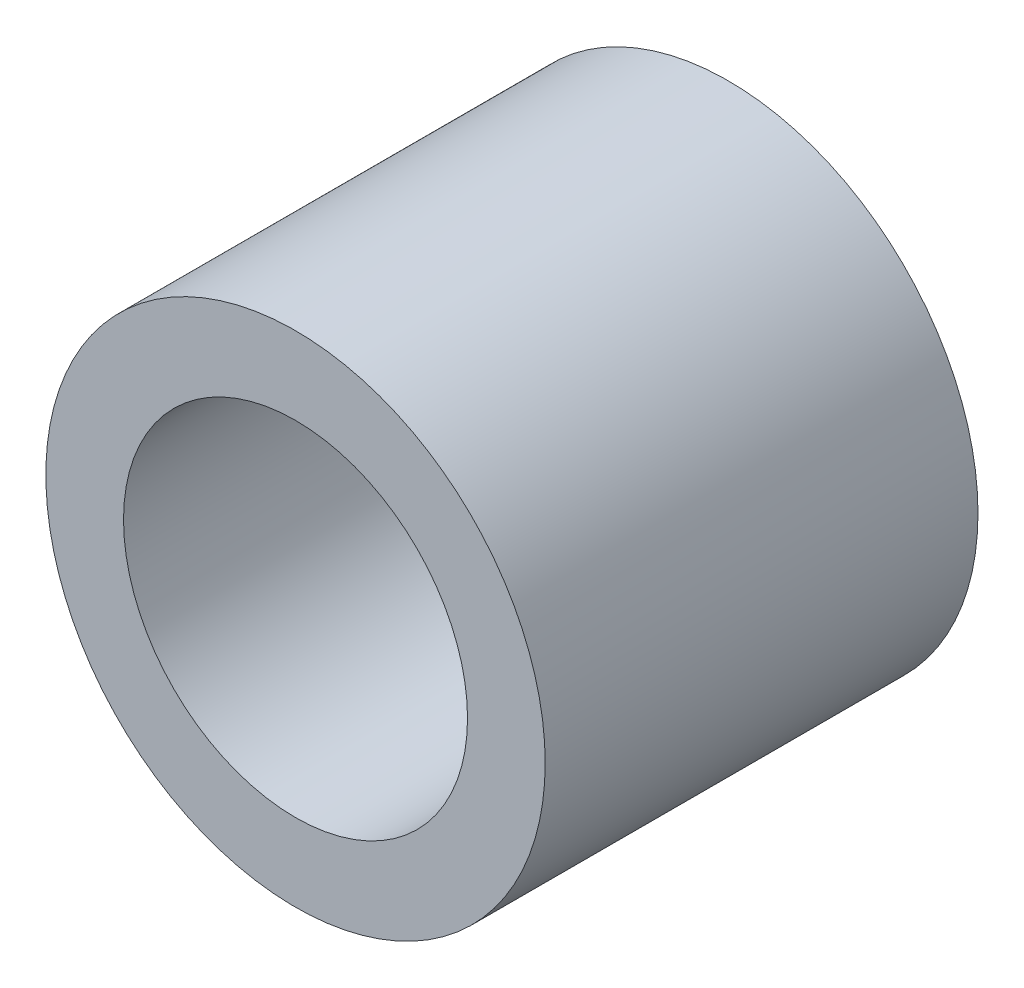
from build123d import *

# Parameters (mm, degrees)
SK_CASQUILLO_R   = 4.5
SK_CASQUILLO_R_2 = 3.1
CASQUILLO_DEPTH  = 7.8


with BuildPart() as part:
    # Sk_Casquillo → Casquillo (new body)
    with BuildSketch(Plane.XY.offset(6.2)):
        with Locations((-36, -62)):
            Circle(SK_CASQUILLO_R)
        with Locations((-36, -62)):
            Circle(SK_CASQUILLO_R_2, mode=Mode.SUBTRACT)
    extrude(amount=CASQUILLO_DEPTH)


solid = part.part
